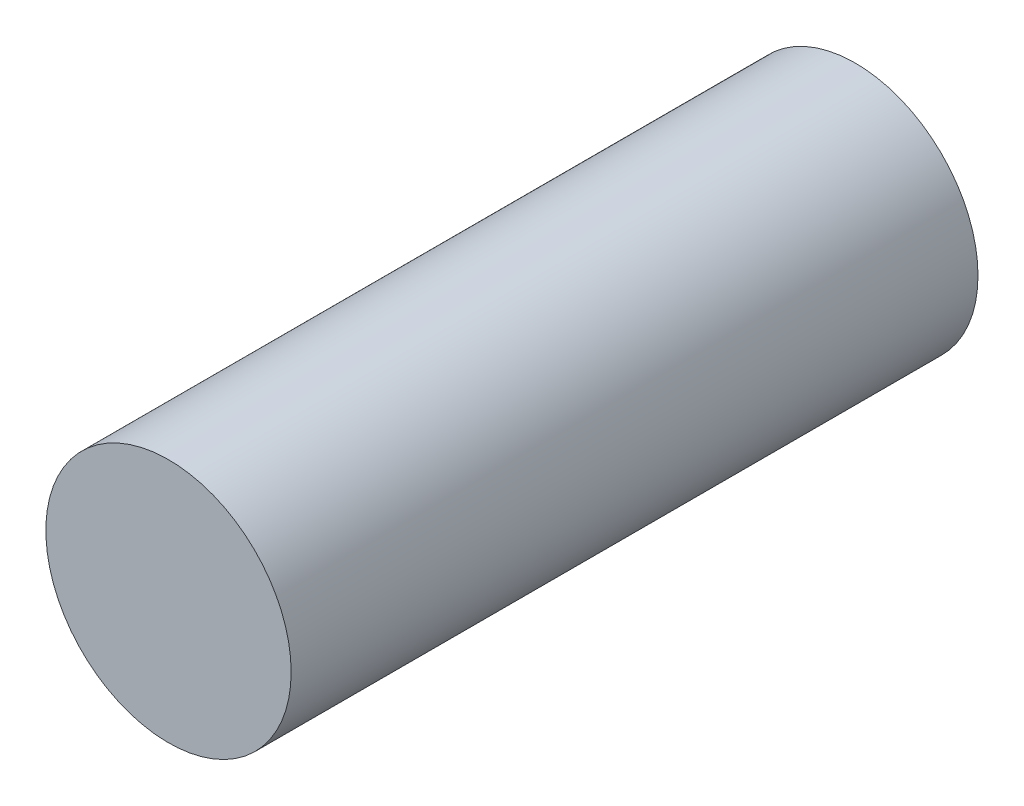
from build123d import *

# Parameters (mm, degrees)
ESQUISSE1_R      = 1.25
EXTRUSION1_DEPTH = 7


with BuildPart() as part:
    # Esquisse1 → Extrusion1 (new body)
    with BuildSketch(Plane.XY):
        with Locations((-26.117230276, 26.909854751)):
            Circle(ESQUISSE1_R)
    extrude(amount=-EXTRUSION1_DEPTH)


solid = part.part
